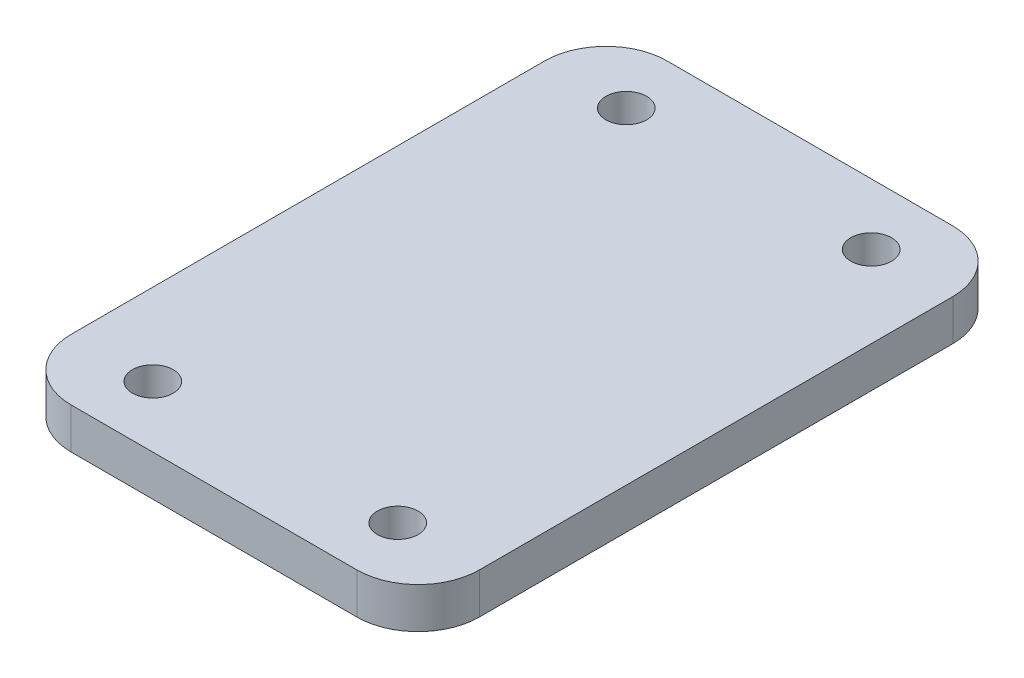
from build123d import *

# Parameters (mm, degrees)
SKETCH1_W            = 100
SKETCH1_H            = 146
BOSS_EXTRUDE1_DEPTH  = 10
FILLET1_R            = 15
SKETCH2_R            = 5
CUT_EXTRUDE1_DEPTH   = 90.044932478
LPATTERN1_COUNT      = 2
LPATTERN1_PITCH      = 116
LPATTERN1_COUNT_DIR2 = 2
LPATTERN1_PITCH_DIR2 = 60


with BuildPart() as part:
    # Sketch1 → Boss-Extrude1 (new body)
    with BuildSketch(Plane(origin=(0, 0, 0), x_dir=(1, 0, 0), z_dir=(0, 1, 0))):
        Rectangle(SKETCH1_W, SKETCH1_H)
    extrude(amount=BOSS_EXTRUDE1_DEPTH)

    # Fillet1
    fillet1_edges = [part.edges().sort_by_distance(p)[0] for p in [
        (50, 5, 73),
        (-50, 5, 73),
        (-50, 5, -73),
        (50, 5, -73),
    ]]
    fillet(fillet1_edges, radius=FILLET1_R)

    # Sketch2 → Cut-Extrude1 (cut, through all)
    with BuildSketch(Plane(origin=(0, 10, 0), x_dir=(1, 0, 0), z_dir=(0, 1, 0))):
        with Locations(Location((-30, -58, 0), (0, 0, 270))):
            Circle(SKETCH2_R)
    cut_extrude1 = extrude(amount=-CUT_EXTRUDE1_DEPTH, mode=Mode.SUBTRACT)

    # LPattern1: Cut-Extrude1 2 × 2
    with Locations(*[(j * LPATTERN1_PITCH_DIR2, 0, -i * LPATTERN1_PITCH) for i in range(LPATTERN1_COUNT) for j in range(LPATTERN1_COUNT_DIR2) if (i, j) != (0, 0)]):
        add(cut_extrude1, mode=Mode.SUBTRACT)


solid = part.part
